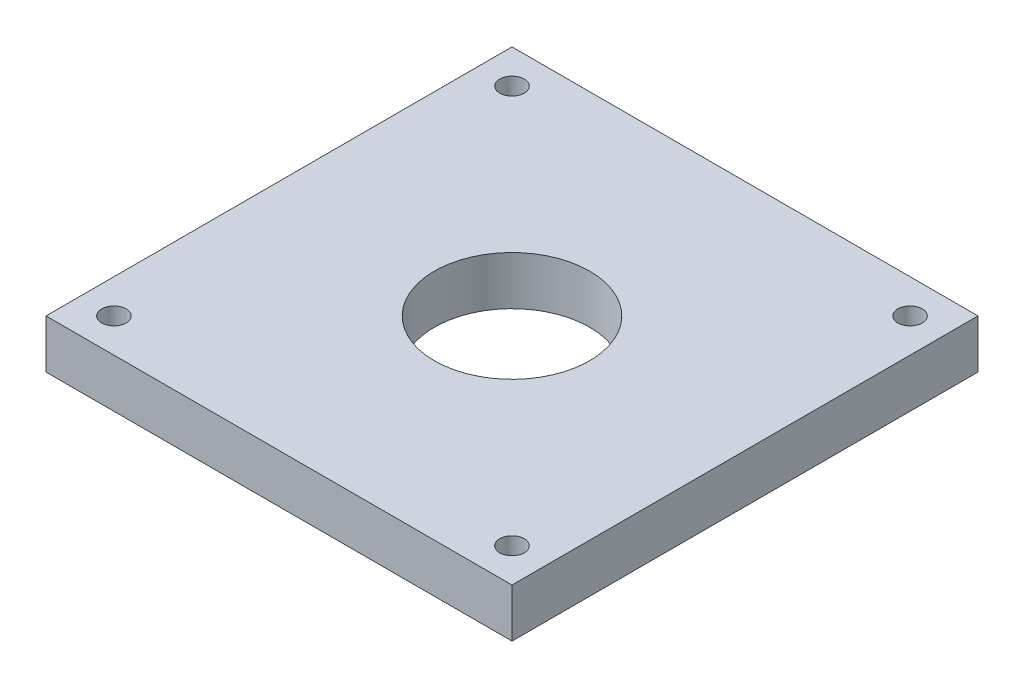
ISO-10303-21;
HEADER;
FILE_DESCRIPTION(('STEP AP214'),'2;1');
FILE_NAME('part.step','',(''),(''),'','','');
FILE_SCHEMA(('AUTOMOTIVE_DESIGN { 1 0 10303 214 1 1 1 1 }'));
ENDSEC;
DATA;
#1=APPLICATION_CONTEXT('core data for automotive mechanical design processes');
#2=APPLICATION_PROTOCOL_DEFINITION('international standard','automotive_design',2000,#1);
#3=PRODUCT_CONTEXT('',#1,'mechanical');
#4=PRODUCT('Part','Part','',(#3));
#5=PRODUCT_RELATED_PRODUCT_CATEGORY('part','',(#4));
#6=PRODUCT_DEFINITION_FORMATION('','',#4);
#7=PRODUCT_DEFINITION_CONTEXT('part definition',#1,'design');
#8=PRODUCT_DEFINITION('design','',#6,#7);
#9=PRODUCT_DEFINITION_SHAPE('','',#8);
#10=(LENGTH_UNIT() NAMED_UNIT(*) SI_UNIT(.MILLI.,.METRE.));
#11=(NAMED_UNIT(*) PLANE_ANGLE_UNIT() SI_UNIT($,.RADIAN.));
#12=(NAMED_UNIT(*) SI_UNIT($,.STERADIAN.) SOLID_ANGLE_UNIT());
#13=UNCERTAINTY_MEASURE_WITH_UNIT(LENGTH_MEASURE(1.E-05),#10,'distance_accuracy_value','');
#14=(GEOMETRIC_REPRESENTATION_CONTEXT(3) GLOBAL_UNCERTAINTY_ASSIGNED_CONTEXT((#13)) GLOBAL_UNIT_ASSIGNED_CONTEXT((#10,
#11,#12)) REPRESENTATION_CONTEXT('',''));
#15=CARTESIAN_POINT('',(0.,0.,0.));
#16=DIRECTION('',(0.,0.,1.));
#17=DIRECTION('',(1.,0.,0.));
#18=AXIS2_PLACEMENT_3D('',#15,#16,#17);
#19=CARTESIAN_POINT('',(-62.3952771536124,7.9502,-40.8176596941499));
#20=DIRECTION('',(1.,0.,0.));
#21=DIRECTION('',(0.,0.,-1.));
#22=AXIS2_PLACEMENT_3D('',#19,#20,#21);
#23=PLANE('',#22);
#24=DIRECTION('',(0.,0.,1.));
#25=VECTOR('',#24,1.);
#26=CARTESIAN_POINT('',(-62.3952771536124,0.,-40.8176596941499));
#27=LINE('',#26,#25);
#28=CARTESIAN_POINT('',(-62.3952771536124,0.,-40.8176596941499));
#29=VERTEX_POINT('',#28);
#30=CARTESIAN_POINT('',(-62.3952771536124,0.,35.3823403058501));
#31=VERTEX_POINT('',#30);
#32=EDGE_CURVE('E99',#29,#31,#27,.T.);
#33=ORIENTED_EDGE('',*,*,#32,.T.);
#34=DIRECTION('',(0.,-1.,0.));
#35=VECTOR('',#34,1.);
#36=CARTESIAN_POINT('',(-62.3952771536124,7.9502,35.3823403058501));
#37=LINE('',#36,#35);
#38=CARTESIAN_POINT('',(-62.3952771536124,7.9502,35.3823403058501));
#39=VERTEX_POINT('',#38);
#40=EDGE_CURVE('E11',#39,#31,#37,.T.);
#41=ORIENTED_EDGE('',*,*,#40,.F.);
#42=DIRECTION('',(0.,0.,1.));
#43=VECTOR('',#42,1.);
#44=CARTESIAN_POINT('',(-62.3952771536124,7.9502,-40.8176596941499));
#45=LINE('',#44,#43);
#46=CARTESIAN_POINT('',(-62.3952771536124,7.9502,-40.8176596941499));
#47=VERTEX_POINT('',#46);
#48=EDGE_CURVE('E86',#47,#39,#45,.T.);
#49=ORIENTED_EDGE('',*,*,#48,.F.);
#50=DIRECTION('',(0.,-1.,0.));
#51=VECTOR('',#50,1.);
#52=CARTESIAN_POINT('',(-62.3952771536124,7.9502,-40.8176596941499));
#53=LINE('',#52,#51);
#54=EDGE_CURVE('E95',#47,#29,#53,.T.);
#55=ORIENTED_EDGE('',*,*,#54,.T.);
#56=EDGE_LOOP('',(#33,#41,#49,#55));
#57=FACE_BOUND('',#56,.T.);
#58=ADVANCED_FACE('F33',(#57),#23,.F.);
#59=CARTESIAN_POINT('',(-62.3952771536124,7.9502,35.3823403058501));
#60=DIRECTION('',(0.,0.,-1.));
#61=DIRECTION('',(-1.,0.,0.));
#62=AXIS2_PLACEMENT_3D('',#59,#60,#61);
#63=PLANE('',#62);
#64=DIRECTION('',(1.,0.,0.));
#65=VECTOR('',#64,1.);
#66=CARTESIAN_POINT('',(-62.3952771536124,0.,35.3823403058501));
#67=LINE('',#66,#65);
#68=CARTESIAN_POINT('',(13.8047228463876,0.,35.3823403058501));
#69=VERTEX_POINT('',#68);
#70=EDGE_CURVE('E90',#31,#69,#67,.T.);
#71=ORIENTED_EDGE('',*,*,#70,.T.);
#72=DIRECTION('',(0.,-1.,0.));
#73=VECTOR('',#72,1.);
#74=CARTESIAN_POINT('',(13.8047228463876,7.9502,35.3823403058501));
#75=LINE('',#74,#73);
#76=CARTESIAN_POINT('',(13.8047228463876,7.9502,35.3823403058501));
#77=VERTEX_POINT('',#76);
#78=EDGE_CURVE('E42',#77,#69,#75,.T.);
#79=ORIENTED_EDGE('',*,*,#78,.F.);
#80=DIRECTION('',(1.,0.,0.));
#81=VECTOR('',#80,1.);
#82=CARTESIAN_POINT('',(-62.3952771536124,7.9502,35.3823403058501));
#83=LINE('',#82,#81);
#84=EDGE_CURVE('E81',#39,#77,#83,.T.);
#85=ORIENTED_EDGE('',*,*,#84,.F.);
#86=ORIENTED_EDGE('',*,*,#40,.T.);
#87=EDGE_LOOP('',(#71,#79,#85,#86));
#88=FACE_BOUND('',#87,.T.);
#89=ADVANCED_FACE('F89',(#88),#63,.F.);
#90=CARTESIAN_POINT('',(13.8047228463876,7.9502,-40.8176596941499));
#91=DIRECTION('',(-1.,0.,0.));
#92=DIRECTION('',(0.,0.,1.));
#93=AXIS2_PLACEMENT_3D('',#90,#91,#92);
#94=PLANE('',#93);
#95=DIRECTION('',(0.,0.,-1.));
#96=VECTOR('',#95,1.);
#97=CARTESIAN_POINT('',(13.8047228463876,0.,-40.8176596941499));
#98=LINE('',#97,#96);
#99=CARTESIAN_POINT('',(13.8047228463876,0.,-40.8176596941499));
#100=VERTEX_POINT('',#99);
#101=EDGE_CURVE('E68',#69,#100,#98,.T.);
#102=ORIENTED_EDGE('',*,*,#101,.T.);
#103=DIRECTION('',(0.,-1.,0.));
#104=VECTOR('',#103,1.);
#105=CARTESIAN_POINT('',(13.8047228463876,7.9502,-40.8176596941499));
#106=LINE('',#105,#104);
#107=CARTESIAN_POINT('',(13.8047228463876,7.9502,-40.8176596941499));
#108=VERTEX_POINT('',#107);
#109=EDGE_CURVE('E91',#108,#100,#106,.T.);
#110=ORIENTED_EDGE('',*,*,#109,.F.);
#111=DIRECTION('',(0.,0.,-1.));
#112=VECTOR('',#111,1.);
#113=CARTESIAN_POINT('',(13.8047228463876,7.9502,-40.8176596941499));
#114=LINE('',#113,#112);
#115=EDGE_CURVE('E84',#77,#108,#114,.T.);
#116=ORIENTED_EDGE('',*,*,#115,.F.);
#117=ORIENTED_EDGE('',*,*,#78,.T.);
#118=EDGE_LOOP('',(#102,#110,#116,#117));
#119=FACE_BOUND('',#118,.T.);
#120=ADVANCED_FACE('F93',(#119),#94,.F.);
#121=CARTESIAN_POINT('',(-62.3952771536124,7.9502,-40.8176596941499));
#122=DIRECTION('',(0.,0.,1.));
#123=DIRECTION('',(1.,0.,0.));
#124=AXIS2_PLACEMENT_3D('',#121,#122,#123);
#125=PLANE('',#124);
#126=DIRECTION('',(-1.,0.,0.));
#127=VECTOR('',#126,1.);
#128=CARTESIAN_POINT('',(-62.3952771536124,0.,-40.8176596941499));
#129=LINE('',#128,#127);
#130=EDGE_CURVE('E74',#100,#29,#129,.T.);
#131=ORIENTED_EDGE('',*,*,#130,.T.);
#132=ORIENTED_EDGE('',*,*,#54,.F.);
#133=DIRECTION('',(-1.,0.,0.));
#134=VECTOR('',#133,1.);
#135=CARTESIAN_POINT('',(-62.3952771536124,7.9502,-40.8176596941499));
#136=LINE('',#135,#134);
#137=EDGE_CURVE('E51',#108,#47,#136,.T.);
#138=ORIENTED_EDGE('',*,*,#137,.F.);
#139=ORIENTED_EDGE('',*,*,#109,.T.);
#140=EDGE_LOOP('',(#131,#132,#138,#139));
#141=FACE_BOUND('',#140,.T.);
#142=ADVANCED_FACE('F138',(#141),#125,.F.);
#143=CARTESIAN_POINT('',(-62.3952771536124,7.9502,35.3823403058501));
#144=DIRECTION('',(0.,1.,0.));
#145=DIRECTION('',(0.,0.,1.));
#146=AXIS2_PLACEMENT_3D('',#143,#144,#145);
#147=PLANE('',#146);
#148=CARTESIAN_POINT('',(-24.2952771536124,7.9502,-2.71765969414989));
#149=DIRECTION('',(0.,1.,0.));
#150=DIRECTION('',(0.,0.,1.));
#151=AXIS2_PLACEMENT_3D('',#148,#149,#150);
#152=CIRCLE('',#151,12.7);
#153=CARTESIAN_POINT('',(-24.2952771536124,7.9502,9.98234030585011));
#154=VERTEX_POINT('',#153);
#155=EDGE_CURVE('E231',#154,#154,#152,.T.);
#156=ORIENTED_EDGE('',*,*,#155,.F.);
#157=EDGE_LOOP('',(#156));
#158=FACE_BOUND('',#157,.T.);
#159=CARTESIAN_POINT('',(-56.8390271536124,7.9502,-35.2614096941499));
#160=DIRECTION('',(0.,1.,0.));
#161=DIRECTION('',(0.,0.,1.));
#162=AXIS2_PLACEMENT_3D('',#159,#160,#161);
#163=CIRCLE('',#162,1.99999999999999);
#164=CARTESIAN_POINT('',(-56.8390271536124,7.9502,-33.2614096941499));
#165=VERTEX_POINT('',#164);
#166=EDGE_CURVE('E126',#165,#165,#163,.T.);
#167=ORIENTED_EDGE('',*,*,#166,.F.);
#168=EDGE_LOOP('',(#167));
#169=FACE_BOUND('',#168,.T.);
#170=CARTESIAN_POINT('',(8.2484728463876,7.9502,-35.2614096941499));
#171=DIRECTION('',(0.,1.,0.));
#172=DIRECTION('',(0.,0.,1.));
#173=AXIS2_PLACEMENT_3D('',#170,#171,#172);
#174=CIRCLE('',#173,1.99999999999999);
#175=CARTESIAN_POINT('',(8.2484728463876,7.9502,-33.2614096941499));
#176=VERTEX_POINT('',#175);
#177=EDGE_CURVE('E116',#176,#176,#174,.T.);
#178=ORIENTED_EDGE('',*,*,#177,.F.);
#179=EDGE_LOOP('',(#178));
#180=FACE_BOUND('',#179,.T.);
#181=CARTESIAN_POINT('',(-56.8390271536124,7.9502,29.8260903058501));
#182=DIRECTION('',(0.,1.,0.));
#183=DIRECTION('',(0.,0.,1.));
#184=AXIS2_PLACEMENT_3D('',#181,#182,#183);
#185=CIRCLE('',#184,1.99999999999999);
#186=CARTESIAN_POINT('',(-56.8390271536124,7.9502,31.8260903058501));
#187=VERTEX_POINT('',#186);
#188=EDGE_CURVE('E113',#187,#187,#185,.T.);
#189=ORIENTED_EDGE('',*,*,#188,.F.);
#190=EDGE_LOOP('',(#189));
#191=FACE_BOUND('',#190,.T.);
#192=CARTESIAN_POINT('',(8.24847284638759,7.9502,29.8260903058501));
#193=DIRECTION('',(0.,1.,0.));
#194=DIRECTION('',(0.,0.,1.));
#195=AXIS2_PLACEMENT_3D('',#192,#193,#194);
#196=CIRCLE('',#195,1.99999999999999);
#197=CARTESIAN_POINT('',(8.24847284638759,7.9502,31.8260903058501));
#198=VERTEX_POINT('',#197);
#199=EDGE_CURVE('E110',#198,#198,#196,.T.);
#200=ORIENTED_EDGE('',*,*,#199,.F.);
#201=EDGE_LOOP('',(#200));
#202=FACE_BOUND('',#201,.T.);
#203=ORIENTED_EDGE('',*,*,#48,.T.);
#204=ORIENTED_EDGE('',*,*,#84,.T.);
#205=ORIENTED_EDGE('',*,*,#115,.T.);
#206=ORIENTED_EDGE('',*,*,#137,.T.);
#207=EDGE_LOOP('',(#203,#204,#205,#206));
#208=FACE_BOUND('',#207,.T.);
#209=ADVANCED_FACE('F82',(#158,#169,#180,#191,#202,#208),#147,.T.);
#210=CARTESIAN_POINT('',(-62.3952771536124,0.,35.3823403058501));
#211=DIRECTION('',(0.,1.,0.));
#212=DIRECTION('',(0.,0.,1.));
#213=AXIS2_PLACEMENT_3D('',#210,#211,#212);
#214=PLANE('',#213);
#215=CARTESIAN_POINT('',(-24.2952771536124,0.,-2.71765969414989));
#216=DIRECTION('',(0.,1.,0.));
#217=DIRECTION('',(0.,0.,1.));
#218=AXIS2_PLACEMENT_3D('',#215,#216,#217);
#219=CIRCLE('',#218,12.7);
#220=CARTESIAN_POINT('',(-24.2952771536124,0.,9.98234030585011));
#221=VERTEX_POINT('',#220);
#222=EDGE_CURVE('E229',#221,#221,#219,.T.);
#223=ORIENTED_EDGE('',*,*,#222,.T.);
#224=EDGE_LOOP('',(#223));
#225=FACE_BOUND('',#224,.T.);
#226=CARTESIAN_POINT('',(-56.8390271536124,0.,-35.2614096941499));
#227=DIRECTION('',(0.,1.,0.));
#228=DIRECTION('',(0.,0.,1.));
#229=AXIS2_PLACEMENT_3D('',#226,#227,#228);
#230=CIRCLE('',#229,1.99999999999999);
#231=CARTESIAN_POINT('',(-56.8390271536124,0.,-33.2614096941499));
#232=VERTEX_POINT('',#231);
#233=EDGE_CURVE('E36',#232,#232,#230,.T.);
#234=ORIENTED_EDGE('',*,*,#233,.T.);
#235=EDGE_LOOP('',(#234));
#236=FACE_BOUND('',#235,.T.);
#237=CARTESIAN_POINT('',(8.2484728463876,0.,-35.2614096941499));
#238=DIRECTION('',(0.,1.,0.));
#239=DIRECTION('',(0.,0.,1.));
#240=AXIS2_PLACEMENT_3D('',#237,#238,#239);
#241=CIRCLE('',#240,1.99999999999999);
#242=CARTESIAN_POINT('',(8.2484728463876,0.,-33.2614096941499));
#243=VERTEX_POINT('',#242);
#244=EDGE_CURVE('E114',#243,#243,#241,.T.);
#245=ORIENTED_EDGE('',*,*,#244,.T.);
#246=EDGE_LOOP('',(#245));
#247=FACE_BOUND('',#246,.T.);
#248=CARTESIAN_POINT('',(-56.8390271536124,0.,29.8260903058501));
#249=DIRECTION('',(0.,1.,0.));
#250=DIRECTION('',(0.,0.,1.));
#251=AXIS2_PLACEMENT_3D('',#248,#249,#250);
#252=CIRCLE('',#251,1.99999999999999);
#253=CARTESIAN_POINT('',(-56.8390271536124,0.,31.8260903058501));
#254=VERTEX_POINT('',#253);
#255=EDGE_CURVE('E111',#254,#254,#252,.T.);
#256=ORIENTED_EDGE('',*,*,#255,.T.);
#257=EDGE_LOOP('',(#256));
#258=FACE_BOUND('',#257,.T.);
#259=CARTESIAN_POINT('',(8.24847284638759,0.,29.8260903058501));
#260=DIRECTION('',(0.,1.,0.));
#261=DIRECTION('',(0.,0.,1.));
#262=AXIS2_PLACEMENT_3D('',#259,#260,#261);
#263=CIRCLE('',#262,1.99999999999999);
#264=CARTESIAN_POINT('',(8.24847284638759,0.,31.8260903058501));
#265=VERTEX_POINT('',#264);
#266=EDGE_CURVE('E102',#265,#265,#263,.T.);
#267=ORIENTED_EDGE('',*,*,#266,.T.);
#268=EDGE_LOOP('',(#267));
#269=FACE_BOUND('',#268,.T.);
#270=ORIENTED_EDGE('',*,*,#32,.F.);
#271=ORIENTED_EDGE('',*,*,#130,.F.);
#272=ORIENTED_EDGE('',*,*,#101,.F.);
#273=ORIENTED_EDGE('',*,*,#70,.F.);
#274=EDGE_LOOP('',(#270,#271,#272,#273));
#275=FACE_BOUND('',#274,.T.);
#276=ADVANCED_FACE('F137',(#225,#236,#247,#258,#269,#275),#214,.F.);
#277=CARTESIAN_POINT('',(8.24847284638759,7.9502,29.8260903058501));
#278=DIRECTION('',(0.,1.,0.));
#279=DIRECTION('',(0.,0.,1.));
#280=AXIS2_PLACEMENT_3D('',#277,#278,#279);
#281=CYLINDRICAL_SURFACE('',#280,1.99999999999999);
#282=ORIENTED_EDGE('',*,*,#199,.T.);
#283=EDGE_LOOP('',(#282));
#284=FACE_BOUND('',#283,.T.);
#285=ORIENTED_EDGE('',*,*,#266,.F.);
#286=EDGE_LOOP('',(#285));
#287=FACE_BOUND('',#286,.T.);
#288=ADVANCED_FACE('F133',(#284,#287),#281,.F.);
#289=CARTESIAN_POINT('',(-56.8390271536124,7.9502,29.8260903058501));
#290=DIRECTION('',(0.,1.,0.));
#291=DIRECTION('',(0.,0.,1.));
#292=AXIS2_PLACEMENT_3D('',#289,#290,#291);
#293=CYLINDRICAL_SURFACE('',#292,1.99999999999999);
#294=ORIENTED_EDGE('',*,*,#188,.T.);
#295=EDGE_LOOP('',(#294));
#296=FACE_BOUND('',#295,.T.);
#297=ORIENTED_EDGE('',*,*,#255,.F.);
#298=EDGE_LOOP('',(#297));
#299=FACE_BOUND('',#298,.T.);
#300=ADVANCED_FACE('F187',(#296,#299),#293,.F.);
#301=CARTESIAN_POINT('',(8.2484728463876,7.9502,-35.2614096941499));
#302=DIRECTION('',(0.,1.,0.));
#303=DIRECTION('',(0.,0.,1.));
#304=AXIS2_PLACEMENT_3D('',#301,#302,#303);
#305=CYLINDRICAL_SURFACE('',#304,1.99999999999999);
#306=ORIENTED_EDGE('',*,*,#177,.T.);
#307=EDGE_LOOP('',(#306));
#308=FACE_BOUND('',#307,.T.);
#309=ORIENTED_EDGE('',*,*,#244,.F.);
#310=EDGE_LOOP('',(#309));
#311=FACE_BOUND('',#310,.T.);
#312=ADVANCED_FACE('F192',(#308,#311),#305,.F.);
#313=CARTESIAN_POINT('',(-56.8390271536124,7.9502,-35.2614096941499));
#314=DIRECTION('',(0.,1.,0.));
#315=DIRECTION('',(0.,0.,1.));
#316=AXIS2_PLACEMENT_3D('',#313,#314,#315);
#317=CYLINDRICAL_SURFACE('',#316,1.99999999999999);
#318=ORIENTED_EDGE('',*,*,#166,.T.);
#319=EDGE_LOOP('',(#318));
#320=FACE_BOUND('',#319,.T.);
#321=ORIENTED_EDGE('',*,*,#233,.F.);
#322=EDGE_LOOP('',(#321));
#323=FACE_BOUND('',#322,.T.);
#324=ADVANCED_FACE('F200',(#320,#323),#317,.F.);
#325=CARTESIAN_POINT('',(-24.2952771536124,0.,-2.71765969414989));
#326=DIRECTION('',(0.,1.,0.));
#327=DIRECTION('',(0.,0.,1.));
#328=AXIS2_PLACEMENT_3D('',#325,#326,#327);
#329=CYLINDRICAL_SURFACE('',#328,12.7);
#330=ORIENTED_EDGE('',*,*,#222,.F.);
#331=EDGE_LOOP('',(#330));
#332=FACE_BOUND('',#331,.T.);
#333=ORIENTED_EDGE('',*,*,#155,.T.);
#334=EDGE_LOOP('',(#333));
#335=FACE_BOUND('',#334,.T.);
#336=ADVANCED_FACE('F206',(#332,#335),#329,.F.);
#337=CLOSED_SHELL('',(#58,#89,#120,#142,#209,#276,#288,#300,#312,#324,#336));
#338=MANIFOLD_SOLID_BREP('B2',#337);
#339=ADVANCED_BREP_SHAPE_REPRESENTATION('',(#18,#338),#14);
#340=SHAPE_DEFINITION_REPRESENTATION(#9,#339);
ENDSEC;
END-ISO-10303-21;
